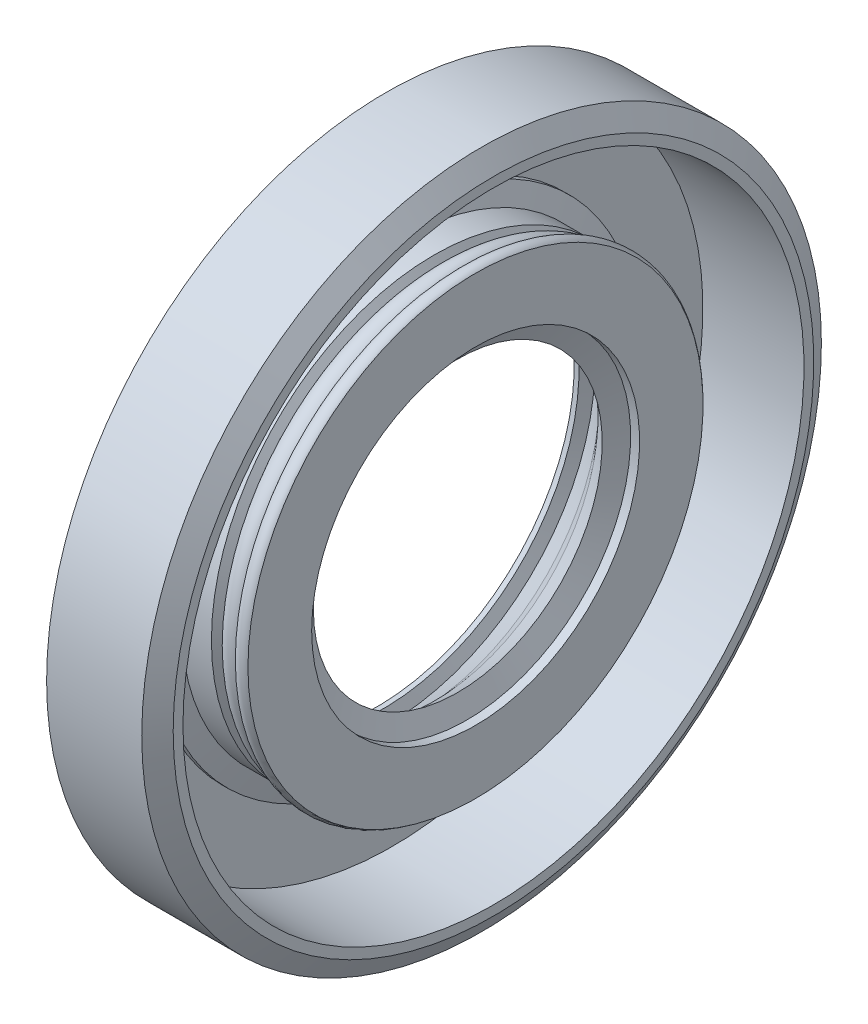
ISO-10303-21;
HEADER;
FILE_DESCRIPTION(('STEP AP214'),'2;1');
FILE_NAME('part.step','',(''),(''),'','','');
FILE_SCHEMA(('AUTOMOTIVE_DESIGN { 1 0 10303 214 1 1 1 1 }'));
ENDSEC;
DATA;
#1=APPLICATION_CONTEXT('core data for automotive mechanical design processes');
#2=APPLICATION_PROTOCOL_DEFINITION('international standard','automotive_design',2000,#1);
#3=PRODUCT_CONTEXT('',#1,'mechanical');
#4=PRODUCT('Part','Part','',(#3));
#5=PRODUCT_RELATED_PRODUCT_CATEGORY('part','',(#4));
#6=PRODUCT_DEFINITION_FORMATION('','',#4);
#7=PRODUCT_DEFINITION_CONTEXT('part definition',#1,'design');
#8=PRODUCT_DEFINITION('design','',#6,#7);
#9=PRODUCT_DEFINITION_SHAPE('','',#8);
#10=(LENGTH_UNIT() NAMED_UNIT(*) SI_UNIT(.MILLI.,.METRE.));
#11=(NAMED_UNIT(*) PLANE_ANGLE_UNIT() SI_UNIT($,.RADIAN.));
#12=(NAMED_UNIT(*) SI_UNIT($,.STERADIAN.) SOLID_ANGLE_UNIT());
#13=UNCERTAINTY_MEASURE_WITH_UNIT(LENGTH_MEASURE(1.E-05),#10,'distance_accuracy_value','');
#14=(GEOMETRIC_REPRESENTATION_CONTEXT(3) GLOBAL_UNCERTAINTY_ASSIGNED_CONTEXT((#13)) GLOBAL_UNIT_ASSIGNED_CONTEXT((#10,
#11,#12)) REPRESENTATION_CONTEXT('',''));
#15=CARTESIAN_POINT('',(0.,0.,0.));
#16=DIRECTION('',(0.,0.,1.));
#17=DIRECTION('',(1.,0.,0.));
#18=AXIS2_PLACEMENT_3D('',#15,#16,#17);
#19=CARTESIAN_POINT('',(7.,0.,0.));
#20=DIRECTION('',(-1.,0.,0.));
#21=DIRECTION('',(0.,0.,1.));
#22=AXIS2_PLACEMENT_3D('',#19,#20,#21);
#23=CYLINDRICAL_SURFACE('',#22,20.);
#24=CARTESIAN_POINT('',(0.7,0.,0.));
#25=DIRECTION('',(-1.,0.,0.));
#26=DIRECTION('',(0.,0.,1.));
#27=AXIS2_PLACEMENT_3D('',#24,#25,#26);
#28=CIRCLE('',#27,20.);
#29=CARTESIAN_POINT('',(0.7,0.,20.));
#30=VERTEX_POINT('',#29);
#31=EDGE_CURVE('E10',#30,#30,#28,.T.);
#32=ORIENTED_EDGE('',*,*,#31,.F.);
#33=EDGE_LOOP('',(#32));
#34=FACE_BOUND('',#33,.T.);
#35=CARTESIAN_POINT('',(6.3,0.,0.));
#36=DIRECTION('',(-1.,0.,0.));
#37=DIRECTION('',(0.,0.,1.));
#38=AXIS2_PLACEMENT_3D('',#35,#36,#37);
#39=CIRCLE('',#38,20.);
#40=CARTESIAN_POINT('',(6.3,0.,20.));
#41=VERTEX_POINT('',#40);
#42=EDGE_CURVE('E87',#41,#41,#39,.T.);
#43=ORIENTED_EDGE('',*,*,#42,.T.);
#44=EDGE_LOOP('',(#43));
#45=FACE_BOUND('',#44,.T.);
#46=ADVANCED_FACE('F14',(#34,#45),#23,.T.);
#47=CARTESIAN_POINT('',(0.7,0.,0.));
#48=DIRECTION('',(1.,0.,0.));
#49=DIRECTION('',(0.,0.,-1.));
#50=AXIS2_PLACEMENT_3D('',#47,#48,#49);
#51=CONICAL_SURFACE('',#50,20.,1.02400748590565);
#52=CARTESIAN_POINT('',(0.,0.,0.));
#53=DIRECTION('',(-1.,0.,0.));
#54=DIRECTION('',(0.,0.,1.));
#55=AXIS2_PLACEMENT_3D('',#52,#53,#54);
#56=CIRCLE('',#55,18.85);
#57=CARTESIAN_POINT('',(0.,0.,18.85));
#58=VERTEX_POINT('',#57);
#59=EDGE_CURVE('E20',#58,#58,#56,.T.);
#60=ORIENTED_EDGE('',*,*,#59,.F.);
#61=EDGE_LOOP('',(#60));
#62=FACE_BOUND('',#61,.T.);
#63=ORIENTED_EDGE('',*,*,#31,.T.);
#64=EDGE_LOOP('',(#63));
#65=FACE_BOUND('',#64,.T.);
#66=ADVANCED_FACE('F214',(#62,#65),#51,.T.);
#67=CARTESIAN_POINT('',(0.,18.85,0.));
#68=DIRECTION('',(1.,0.,0.));
#69=DIRECTION('',(0.,0.,-1.));
#70=AXIS2_PLACEMENT_3D('',#67,#68,#69);
#71=PLANE('',#70);
#72=CARTESIAN_POINT('',(0.,0.,0.));
#73=DIRECTION('',(-1.,0.,0.));
#74=DIRECTION('',(0.,0.,1.));
#75=AXIS2_PLACEMENT_3D('',#72,#73,#74);
#76=CIRCLE('',#75,13.1);
#77=CARTESIAN_POINT('',(0.,0.,13.1));
#78=VERTEX_POINT('',#77);
#79=EDGE_CURVE('E24',#78,#78,#76,.T.);
#80=ORIENTED_EDGE('',*,*,#79,.F.);
#81=EDGE_LOOP('',(#80));
#82=FACE_BOUND('',#81,.T.);
#83=ORIENTED_EDGE('',*,*,#59,.T.);
#84=EDGE_LOOP('',(#83));
#85=FACE_BOUND('',#84,.T.);
#86=ADVANCED_FACE('F209',(#82,#85),#71,.F.);
#87=CARTESIAN_POINT('',(0.,0.,0.));
#88=DIRECTION('',(-1.,0.,0.));
#89=DIRECTION('',(0.,0.,1.));
#90=AXIS2_PLACEMENT_3D('',#87,#88,#89);
#91=CONICAL_SURFACE('',#90,13.1,0.785398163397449);
#92=CARTESIAN_POINT('',(0.494974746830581,0.,0.));
#93=DIRECTION('',(-1.,0.,0.));
#94=DIRECTION('',(0.,0.,1.));
#95=AXIS2_PLACEMENT_3D('',#92,#93,#94);
#96=CIRCLE('',#95,12.6050252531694);
#97=CARTESIAN_POINT('',(0.494974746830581,0.,12.6050252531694));
#98=VERTEX_POINT('',#97);
#99=EDGE_CURVE('E28',#98,#98,#96,.T.);
#100=ORIENTED_EDGE('',*,*,#99,.F.);
#101=EDGE_LOOP('',(#100));
#102=FACE_BOUND('',#101,.T.);
#103=ORIENTED_EDGE('',*,*,#79,.T.);
#104=EDGE_LOOP('',(#103));
#105=FACE_BOUND('',#104,.T.);
#106=ADVANCED_FACE('F203',(#102,#105),#91,.F.);
#107=CARTESIAN_POINT('',(0.494974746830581,0.,0.));
#108=DIRECTION('',(1.,0.,0.));
#109=DIRECTION('',(0.,0.,-1.));
#110=AXIS2_PLACEMENT_3D('',#107,#108,#109);
#111=CONICAL_SURFACE('',#110,12.6050252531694,1.22173047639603);
#112=CARTESIAN_POINT('',(0.135853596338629,0.,0.));
#113=DIRECTION('',(-1.,0.,0.));
#114=DIRECTION('',(0.,0.,1.));
#115=AXIS2_PLACEMENT_3D('',#112,#113,#114);
#116=CIRCLE('',#115,11.6183480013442);
#117=CARTESIAN_POINT('',(0.135853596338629,0.,11.6183480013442));
#118=VERTEX_POINT('',#117);
#119=EDGE_CURVE('E33',#118,#118,#116,.T.);
#120=ORIENTED_EDGE('',*,*,#119,.F.);
#121=EDGE_LOOP('',(#120));
#122=FACE_BOUND('',#121,.T.);
#123=ORIENTED_EDGE('',*,*,#99,.T.);
#124=EDGE_LOOP('',(#123));
#125=FACE_BOUND('',#124,.T.);
#126=ADVANCED_FACE('F197',(#122,#125),#111,.T.);
#127=CARTESIAN_POINT('',(0.135853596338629,0.,0.));
#128=DIRECTION('',(-1.,0.,0.));
#129=DIRECTION('',(0.,0.,1.));
#130=AXIS2_PLACEMENT_3D('',#127,#128,#129);
#131=CONICAL_SURFACE('',#130,11.6183480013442,0.174532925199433);
#132=CARTESIAN_POINT('',(0.480536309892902,0.,0.));
#133=DIRECTION('',(-1.,0.,0.));
#134=DIRECTION('',(0.,0.,1.));
#135=AXIS2_PLACEMENT_3D('',#132,#133,#134);
#136=CIRCLE('',#135,11.5575711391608);
#137=CARTESIAN_POINT('',(0.480536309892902,0.,11.5575711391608));
#138=VERTEX_POINT('',#137);
#139=EDGE_CURVE('E36',#138,#138,#136,.T.);
#140=ORIENTED_EDGE('',*,*,#139,.F.);
#141=EDGE_LOOP('',(#140));
#142=FACE_BOUND('',#141,.T.);
#143=ORIENTED_EDGE('',*,*,#119,.T.);
#144=EDGE_LOOP('',(#143));
#145=FACE_BOUND('',#144,.T.);
#146=ADVANCED_FACE('F191',(#142,#145),#131,.F.);
#147=CARTESIAN_POINT('',(0.480536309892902,0.,0.));
#148=DIRECTION('',(1.,0.,0.));
#149=DIRECTION('',(0.,0.,-1.));
#150=AXIS2_PLACEMENT_3D('',#147,#148,#149);
#151=CONICAL_SURFACE('',#150,11.5575711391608,1.13446401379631);
#152=CARTESIAN_POINT('',(0.776369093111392,0.,0.));
#153=DIRECTION('',(-1.,0.,0.));
#154=DIRECTION('',(0.,0.,1.));
#155=AXIS2_PLACEMENT_3D('',#152,#153,#154);
#156=CIRCLE('',#155,12.1919865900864);
#157=CARTESIAN_POINT('',(0.776369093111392,0.,12.1919865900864));
#158=VERTEX_POINT('',#157);
#159=EDGE_CURVE('E39',#158,#158,#156,.T.);
#160=ORIENTED_EDGE('',*,*,#159,.F.);
#161=EDGE_LOOP('',(#160));
#162=FACE_BOUND('',#161,.T.);
#163=ORIENTED_EDGE('',*,*,#139,.T.);
#164=EDGE_LOOP('',(#163));
#165=FACE_BOUND('',#164,.T.);
#166=ADVANCED_FACE('F185',(#162,#165),#151,.F.);
#167=CARTESIAN_POINT('',(0.776369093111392,0.,0.));
#168=DIRECTION('',(-1.,0.,0.));
#169=DIRECTION('',(0.,0.,1.));
#170=AXIS2_PLACEMENT_3D('',#167,#168,#169);
#171=CONICAL_SURFACE('',#170,12.1919865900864,0.693783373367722);
#172=CARTESIAN_POINT('',(2.45,0.,0.));
#173=DIRECTION('',(-1.,0.,0.));
#174=DIRECTION('',(0.,0.,1.));
#175=AXIS2_PLACEMENT_3D('',#172,#173,#174);
#176=CIRCLE('',#175,10.8);
#177=CARTESIAN_POINT('',(2.45,0.,10.8));
#178=VERTEX_POINT('',#177);
#179=EDGE_CURVE('E42',#178,#178,#176,.T.);
#180=ORIENTED_EDGE('',*,*,#179,.F.);
#181=EDGE_LOOP('',(#180));
#182=FACE_BOUND('',#181,.T.);
#183=ORIENTED_EDGE('',*,*,#159,.T.);
#184=EDGE_LOOP('',(#183));
#185=FACE_BOUND('',#184,.T.);
#186=ADVANCED_FACE('F179',(#182,#185),#171,.F.);
#187=CARTESIAN_POINT('',(2.45,0.,0.));
#188=DIRECTION('',(-1.,0.,0.));
#189=DIRECTION('',(0.,0.,1.));
#190=AXIS2_PLACEMENT_3D('',#187,#188,#189);
#191=CONICAL_SURFACE('',#190,10.8,0.830821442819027);
#192=CARTESIAN_POINT('',(3.5,0.,0.));
#193=DIRECTION('',(-1.,0.,0.));
#194=DIRECTION('',(0.,0.,1.));
#195=AXIS2_PLACEMENT_3D('',#192,#193,#194);
#196=CIRCLE('',#195,9.65);
#197=CARTESIAN_POINT('',(3.5,0.,9.65));
#198=VERTEX_POINT('',#197);
#199=EDGE_CURVE('E45',#198,#198,#196,.T.);
#200=ORIENTED_EDGE('',*,*,#199,.F.);
#201=EDGE_LOOP('',(#200));
#202=FACE_BOUND('',#201,.T.);
#203=ORIENTED_EDGE('',*,*,#179,.T.);
#204=EDGE_LOOP('',(#203));
#205=FACE_BOUND('',#204,.T.);
#206=ADVANCED_FACE('F173',(#202,#205),#191,.F.);
#207=CARTESIAN_POINT('',(3.5,0.,0.));
#208=DIRECTION('',(-1.,0.,0.));
#209=DIRECTION('',(0.,0.,1.));
#210=AXIS2_PLACEMENT_3D('',#207,#208,#209);
#211=CONICAL_SURFACE('',#210,9.65,0.68767125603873);
#212=CARTESIAN_POINT('',(4.9,0.,0.));
#213=DIRECTION('',(-1.,0.,0.));
#214=DIRECTION('',(0.,0.,1.));
#215=AXIS2_PLACEMENT_3D('',#212,#213,#214);
#216=CIRCLE('',#215,8.5);
#217=CARTESIAN_POINT('',(4.9,0.,8.5));
#218=VERTEX_POINT('',#217);
#219=EDGE_CURVE('E48',#218,#218,#216,.T.);
#220=ORIENTED_EDGE('',*,*,#219,.F.);
#221=EDGE_LOOP('',(#220));
#222=FACE_BOUND('',#221,.T.);
#223=ORIENTED_EDGE('',*,*,#199,.T.);
#224=EDGE_LOOP('',(#223));
#225=FACE_BOUND('',#224,.T.);
#226=ADVANCED_FACE('F167',(#222,#225),#211,.F.);
#227=CARTESIAN_POINT('',(4.9,0.,0.));
#228=DIRECTION('',(1.,0.,0.));
#229=DIRECTION('',(0.,0.,-1.));
#230=AXIS2_PLACEMENT_3D('',#227,#228,#229);
#231=CONICAL_SURFACE('',#230,8.5,1.14212536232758);
#232=CARTESIAN_POINT('',(5.42500145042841,0.,0.));
#233=DIRECTION('',(-1.,0.,0.));
#234=DIRECTION('',(0.,0.,1.));
#235=AXIS2_PLACEMENT_3D('',#232,#233,#234);
#236=CIRCLE('',#235,9.64876592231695);
#237=CARTESIAN_POINT('',(5.42500145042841,0.,9.64876592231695));
#238=VERTEX_POINT('',#237);
#239=EDGE_CURVE('E51',#238,#238,#236,.T.);
#240=ORIENTED_EDGE('',*,*,#239,.F.);
#241=EDGE_LOOP('',(#240));
#242=FACE_BOUND('',#241,.T.);
#243=ORIENTED_EDGE('',*,*,#219,.T.);
#244=EDGE_LOOP('',(#243));
#245=FACE_BOUND('',#244,.T.);
#246=ADVANCED_FACE('F161',(#242,#245),#231,.F.);
#247=CARTESIAN_POINT('',(5.42500145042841,0.,0.));
#248=DIRECTION('',(1.,0.,0.));
#249=DIRECTION('',(0.,0.,-1.));
#250=AXIS2_PLACEMENT_3D('',#247,#248,#249);
#251=CONICAL_SURFACE('',#250,9.64876592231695,0.00235062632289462);
#252=CARTESIAN_POINT('',(5.95,0.,0.));
#253=DIRECTION('',(-1.,0.,0.));
#254=DIRECTION('',(0.,0.,1.));
#255=AXIS2_PLACEMENT_3D('',#252,#253,#254);
#256=CIRCLE('',#255,9.65);
#257=CARTESIAN_POINT('',(5.95,0.,9.65));
#258=VERTEX_POINT('',#257);
#259=EDGE_CURVE('E54',#258,#258,#256,.T.);
#260=ORIENTED_EDGE('',*,*,#259,.F.);
#261=EDGE_LOOP('',(#260));
#262=FACE_BOUND('',#261,.T.);
#263=ORIENTED_EDGE('',*,*,#239,.T.);
#264=EDGE_LOOP('',(#263));
#265=FACE_BOUND('',#264,.T.);
#266=ADVANCED_FACE('F155',(#262,#265),#251,.F.);
#267=CARTESIAN_POINT('',(5.95,0.,0.));
#268=DIRECTION('',(-1.,0.,0.));
#269=DIRECTION('',(0.,0.,1.));
#270=AXIS2_PLACEMENT_3D('',#267,#268,#269);
#271=CONICAL_SURFACE('',#270,9.65,1.568445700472);
#272=CARTESIAN_POINT('',(5.94120580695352,0.,0.));
#273=DIRECTION('',(-1.,0.,0.));
#274=DIRECTION('',(0.,0.,1.));
#275=AXIS2_PLACEMENT_3D('',#272,#273,#274);
#276=CIRCLE('',#275,13.3912058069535);
#277=CARTESIAN_POINT('',(5.94120580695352,0.,13.3912058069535));
#278=VERTEX_POINT('',#277);
#279=EDGE_CURVE('E57',#278,#278,#276,.T.);
#280=ORIENTED_EDGE('',*,*,#279,.F.);
#281=EDGE_LOOP('',(#280));
#282=FACE_BOUND('',#281,.T.);
#283=ORIENTED_EDGE('',*,*,#259,.T.);
#284=EDGE_LOOP('',(#283));
#285=FACE_BOUND('',#284,.T.);
#286=ADVANCED_FACE('F149',(#282,#285),#271,.T.);
#287=CARTESIAN_POINT('',(5.56997474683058,0.,0.));
#288=DIRECTION('',(-1.,0.,0.));
#289=DIRECTION('',(0.,0.,1.));
#290=AXIS2_PLACEMENT_3D('',#287,#288,#289);
#291=TOROIDAL_SURFACE('',#290,13.0199747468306,0.525);
#292=CARTESIAN_POINT('',(5.04497474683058,0.,0.));
#293=DIRECTION('',(-1.,0.,0.));
#294=DIRECTION('',(0.,0.,1.));
#295=AXIS2_PLACEMENT_3D('',#292,#293,#294);
#296=CIRCLE('',#295,13.0199747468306);
#297=CARTESIAN_POINT('',(5.04497474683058,0.,13.0199747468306));
#298=VERTEX_POINT('',#297);
#299=EDGE_CURVE('E60',#298,#298,#296,.T.);
#300=ORIENTED_EDGE('',*,*,#299,.F.);
#301=EDGE_LOOP('',(#300));
#302=FACE_BOUND('',#301,.T.);
#303=ORIENTED_EDGE('',*,*,#279,.T.);
#304=EDGE_LOOP('',(#303));
#305=FACE_BOUND('',#304,.T.);
#306=ADVANCED_FACE('F143',(#302,#305),#291,.T.);
#307=CARTESIAN_POINT('',(4.55,0.,0.));
#308=DIRECTION('',(-1.,0.,0.));
#309=DIRECTION('',(0.,0.,1.));
#310=AXIS2_PLACEMENT_3D('',#307,#308,#309);
#311=TOROIDAL_SURFACE('',#310,12.525,0.7);
#312=CARTESIAN_POINT('',(3.85,0.,0.));
#313=DIRECTION('',(-1.,0.,0.));
#314=DIRECTION('',(0.,0.,1.));
#315=AXIS2_PLACEMENT_3D('',#312,#313,#314);
#316=CIRCLE('',#315,12.525);
#317=CARTESIAN_POINT('',(3.85,0.,12.525));
#318=VERTEX_POINT('',#317);
#319=EDGE_CURVE('E63',#318,#318,#316,.T.);
#320=ORIENTED_EDGE('',*,*,#319,.F.);
#321=EDGE_LOOP('',(#320));
#322=FACE_BOUND('',#321,.T.);
#323=ORIENTED_EDGE('',*,*,#299,.T.);
#324=EDGE_LOOP('',(#323));
#325=FACE_BOUND('',#324,.T.);
#326=ADVANCED_FACE('F137',(#322,#325),#311,.T.);
#327=CARTESIAN_POINT('',(3.85,0.,0.));
#328=DIRECTION('',(-1.,0.,0.));
#329=DIRECTION('',(0.,0.,1.));
#330=AXIS2_PLACEMENT_3D('',#327,#328,#329);
#331=CONICAL_SURFACE('',#330,12.525,1.02400748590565);
#332=CARTESIAN_POINT('',(3.5,0.,0.));
#333=DIRECTION('',(-1.,0.,0.));
#334=DIRECTION('',(0.,0.,1.));
#335=AXIS2_PLACEMENT_3D('',#332,#333,#334);
#336=CIRCLE('',#335,13.1);
#337=CARTESIAN_POINT('',(3.5,0.,13.1));
#338=VERTEX_POINT('',#337);
#339=EDGE_CURVE('E66',#338,#338,#336,.T.);
#340=ORIENTED_EDGE('',*,*,#339,.F.);
#341=EDGE_LOOP('',(#340));
#342=FACE_BOUND('',#341,.T.);
#343=ORIENTED_EDGE('',*,*,#319,.T.);
#344=EDGE_LOOP('',(#343));
#345=FACE_BOUND('',#344,.T.);
#346=ADVANCED_FACE('F131',(#342,#345),#331,.T.);
#347=CARTESIAN_POINT('',(7.,0.,0.));
#348=DIRECTION('',(-1.,0.,0.));
#349=DIRECTION('',(0.,0.,1.));
#350=AXIS2_PLACEMENT_3D('',#347,#348,#349);
#351=CYLINDRICAL_SURFACE('',#350,13.1);
#352=CARTESIAN_POINT('',(1.75,0.,0.));
#353=DIRECTION('',(-1.,0.,0.));
#354=DIRECTION('',(0.,0.,1.));
#355=AXIS2_PLACEMENT_3D('',#352,#353,#354);
#356=CIRCLE('',#355,13.1);
#357=CARTESIAN_POINT('',(1.75,0.,13.1));
#358=VERTEX_POINT('',#357);
#359=EDGE_CURVE('E69',#358,#358,#356,.T.);
#360=ORIENTED_EDGE('',*,*,#359,.F.);
#361=EDGE_LOOP('',(#360));
#362=FACE_BOUND('',#361,.T.);
#363=ORIENTED_EDGE('',*,*,#339,.T.);
#364=EDGE_LOOP('',(#363));
#365=FACE_BOUND('',#364,.T.);
#366=ADVANCED_FACE('F125',(#362,#365),#351,.T.);
#367=CARTESIAN_POINT('',(1.75,0.,0.));
#368=DIRECTION('',(-1.,0.,0.));
#369=DIRECTION('',(0.,0.,1.));
#370=AXIS2_PLACEMENT_3D('',#367,#368,#369);
#371=CONICAL_SURFACE('',#370,13.1,1.27535548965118);
#372=CARTESIAN_POINT('',(1.4,0.,0.));
#373=DIRECTION('',(-1.,0.,0.));
#374=DIRECTION('',(0.,0.,1.));
#375=AXIS2_PLACEMENT_3D('',#372,#373,#374);
#376=CIRCLE('',#375,14.25);
#377=CARTESIAN_POINT('',(1.4,0.,14.25));
#378=VERTEX_POINT('',#377);
#379=EDGE_CURVE('E72',#378,#378,#376,.T.);
#380=ORIENTED_EDGE('',*,*,#379,.F.);
#381=EDGE_LOOP('',(#380));
#382=FACE_BOUND('',#381,.T.);
#383=ORIENTED_EDGE('',*,*,#359,.T.);
#384=EDGE_LOOP('',(#383));
#385=FACE_BOUND('',#384,.T.);
#386=ADVANCED_FACE('F119',(#382,#385),#371,.T.);
#387=CARTESIAN_POINT('',(7.,0.,0.));
#388=DIRECTION('',(-1.,0.,0.));
#389=DIRECTION('',(0.,0.,1.));
#390=AXIS2_PLACEMENT_3D('',#387,#388,#389);
#391=CYLINDRICAL_SURFACE('',#390,14.25);
#392=CARTESIAN_POINT('',(1.05,0.,0.));
#393=DIRECTION('',(-1.,0.,0.));
#394=DIRECTION('',(0.,0.,1.));
#395=AXIS2_PLACEMENT_3D('',#392,#393,#394);
#396=CIRCLE('',#395,14.25);
#397=CARTESIAN_POINT('',(1.05,0.,14.25));
#398=VERTEX_POINT('',#397);
#399=EDGE_CURVE('E75',#398,#398,#396,.T.);
#400=ORIENTED_EDGE('',*,*,#399,.F.);
#401=EDGE_LOOP('',(#400));
#402=FACE_BOUND('',#401,.T.);
#403=ORIENTED_EDGE('',*,*,#379,.T.);
#404=EDGE_LOOP('',(#403));
#405=FACE_BOUND('',#404,.T.);
#406=ADVANCED_FACE('F113',(#402,#405),#391,.T.);
#407=CARTESIAN_POINT('',(1.05,14.25,0.));
#408=DIRECTION('',(-1.,0.,0.));
#409=DIRECTION('',(0.,0.,1.));
#410=AXIS2_PLACEMENT_3D('',#407,#408,#409);
#411=PLANE('',#410);
#412=CARTESIAN_POINT('',(1.05,0.,0.));
#413=DIRECTION('',(-1.,0.,0.));
#414=DIRECTION('',(0.,0.,1.));
#415=AXIS2_PLACEMENT_3D('',#412,#413,#414);
#416=CIRCLE('',#415,18.275);
#417=CARTESIAN_POINT('',(1.05,0.,18.275));
#418=VERTEX_POINT('',#417);
#419=EDGE_CURVE('E78',#418,#418,#416,.T.);
#420=ORIENTED_EDGE('',*,*,#419,.F.);
#421=EDGE_LOOP('',(#420));
#422=FACE_BOUND('',#421,.T.);
#423=ORIENTED_EDGE('',*,*,#399,.T.);
#424=EDGE_LOOP('',(#423));
#425=FACE_BOUND('',#424,.T.);
#426=ADVANCED_FACE('F107',(#422,#425),#411,.F.);
#427=CARTESIAN_POINT('',(7.,0.,0.));
#428=DIRECTION('',(-1.,0.,0.));
#429=DIRECTION('',(0.,0.,1.));
#430=AXIS2_PLACEMENT_3D('',#427,#428,#429);
#431=CYLINDRICAL_SURFACE('',#430,18.275);
#432=CARTESIAN_POINT('',(7.,0.,0.));
#433=DIRECTION('',(-1.,0.,0.));
#434=DIRECTION('',(0.,0.,1.));
#435=AXIS2_PLACEMENT_3D('',#432,#433,#434);
#436=CIRCLE('',#435,18.275);
#437=CARTESIAN_POINT('',(7.,0.,18.275));
#438=VERTEX_POINT('',#437);
#439=EDGE_CURVE('E81',#438,#438,#436,.T.);
#440=ORIENTED_EDGE('',*,*,#439,.F.);
#441=EDGE_LOOP('',(#440));
#442=FACE_BOUND('',#441,.T.);
#443=ORIENTED_EDGE('',*,*,#419,.T.);
#444=EDGE_LOOP('',(#443));
#445=FACE_BOUND('',#444,.T.);
#446=ADVANCED_FACE('F101',(#442,#445),#431,.F.);
#447=CARTESIAN_POINT('',(7.,18.275,0.));
#448=DIRECTION('',(-1.,0.,0.));
#449=DIRECTION('',(0.,0.,1.));
#450=AXIS2_PLACEMENT_3D('',#447,#448,#449);
#451=PLANE('',#450);
#452=CARTESIAN_POINT('',(7.,0.,0.));
#453=DIRECTION('',(-1.,0.,0.));
#454=DIRECTION('',(0.,0.,1.));
#455=AXIS2_PLACEMENT_3D('',#452,#453,#454);
#456=CIRCLE('',#455,18.85);
#457=CARTESIAN_POINT('',(7.,0.,18.85));
#458=VERTEX_POINT('',#457);
#459=EDGE_CURVE('E84',#458,#458,#456,.T.);
#460=ORIENTED_EDGE('',*,*,#459,.F.);
#461=EDGE_LOOP('',(#460));
#462=FACE_BOUND('',#461,.T.);
#463=ORIENTED_EDGE('',*,*,#439,.T.);
#464=EDGE_LOOP('',(#463));
#465=FACE_BOUND('',#464,.T.);
#466=ADVANCED_FACE('F95',(#462,#465),#451,.F.);
#467=CARTESIAN_POINT('',(7.,0.,0.));
#468=DIRECTION('',(-1.,0.,0.));
#469=DIRECTION('',(0.,0.,1.));
#470=AXIS2_PLACEMENT_3D('',#467,#468,#469);
#471=CONICAL_SURFACE('',#470,18.85,1.02400748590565);
#472=ORIENTED_EDGE('',*,*,#42,.F.);
#473=EDGE_LOOP('',(#472));
#474=FACE_BOUND('',#473,.T.);
#475=ORIENTED_EDGE('',*,*,#459,.T.);
#476=EDGE_LOOP('',(#475));
#477=FACE_BOUND('',#476,.T.);
#478=ADVANCED_FACE('F92',(#474,#477),#471,.T.);
#479=CLOSED_SHELL('',(#46,#66,#86,#106,#126,#146,#166,#186,#206,#226,#246,#266,#286,#306,#326,
#346,#366,#386,#406,#426,#446,#466,#478));
#480=MANIFOLD_SOLID_BREP('B1',#479);
#481=ADVANCED_BREP_SHAPE_REPRESENTATION('',(#18,#480),#14);
#482=SHAPE_DEFINITION_REPRESENTATION(#9,#481);
ENDSEC;
END-ISO-10303-21;
